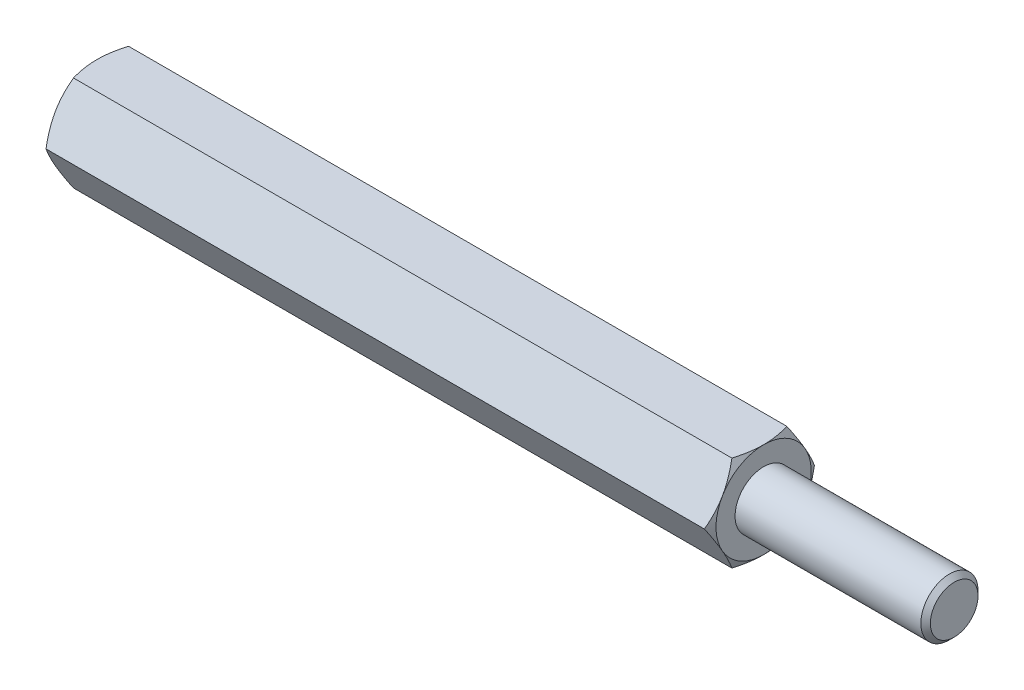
from build123d import *

# Parameters (mm, degrees)
EXTRUDE2_DEPTH = 17.5
SKETCH3_R      = 1.25
EXTRUDE3_DEPTH = 10
SKETCH5_R      = 1.5
EXTRUDE4_DEPTH = 10
CHAMFER1_SIZE  = 0.25


with BuildPart() as part:
    # Sketch1 → Extrude2 (new, symmetric)
    with BuildSketch(Plane(origin=(0, 0, 0), x_dir=(0, 0, -1), z_dir=(1, 0, 0))):
        Polygon((1.443375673, 2.5), (-1.443375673, 2.5), (-2.886751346, 0), (-1.443375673, -2.5), (1.443375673, -2.5), (2.886751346, 0), align=None)
    extrude(amount=EXTRUDE2_DEPTH, both=True)

    # Sketch2 → Cut-Revolve1 (revolve, cut)
    with BuildSketch(Plane.XY):
        with BuildLine():
            Line((-17.5, 2.5), (-16, 5.098076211))
            ThreePointArc((-16, 5.098076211), (-16.48810136, 6.276457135), (-17.5, 5.5))
            Line((-17.5, 5.5), (-17.5, 2.5))
        make_face()
    cut_revolve1 = revolve(axis=Axis((0, 0, 0), (1, 0, 0)), mode=Mode.SUBTRACT)

    # Mirror1: Cut-Revolve1 across plane
    add(cut_revolve1.mirror(Plane(origin=(0, 0, 0), x_dir=(0, 0, 1), z_dir=(1, 0, 0))), mode=Mode.SUBTRACT)

    # Sketch3 → Extrude3 (cut)
    with BuildSketch(Plane.ZY.offset(17.5)):
        Circle(SKETCH3_R)
    extrude(amount=-EXTRUDE3_DEPTH, mode=Mode.SUBTRACT)

    # Sketch4 → Cut-Revolve2 (revolve, cut)
    with BuildSketch(Plane.XY, mode=Mode.PRIVATE) as cut_revolve2_sk:
        Polygon((-7.5, 0), (-7.5, 1.25), (-6.778312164, 0), align=None)
    revolve(cut_revolve2_sk.sketch.rotate(Axis((-6.778312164, 0, 0), (-1, 0, 0)), 270), axis=Axis((-6.778312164, 0, 0), (-1, 0, 0)), mode=Mode.SUBTRACT)

    # Sketch5 → Extrude4 (add)
    with BuildSketch(Plane(origin=(17.5, 0, 0), x_dir=(0, 0, -1), z_dir=(1, 0, 0))):
        Circle(SKETCH5_R)
    extrude(amount=EXTRUDE4_DEPTH)

    # Chamfer1
    chamfer1_edges = [part.edges().sort_by_distance(p)[0] for p in [
        (27.5, 0, 1.5),
    ]]
    chamfer(chamfer1_edges, length=CHAMFER1_SIZE)


solid = part.part
